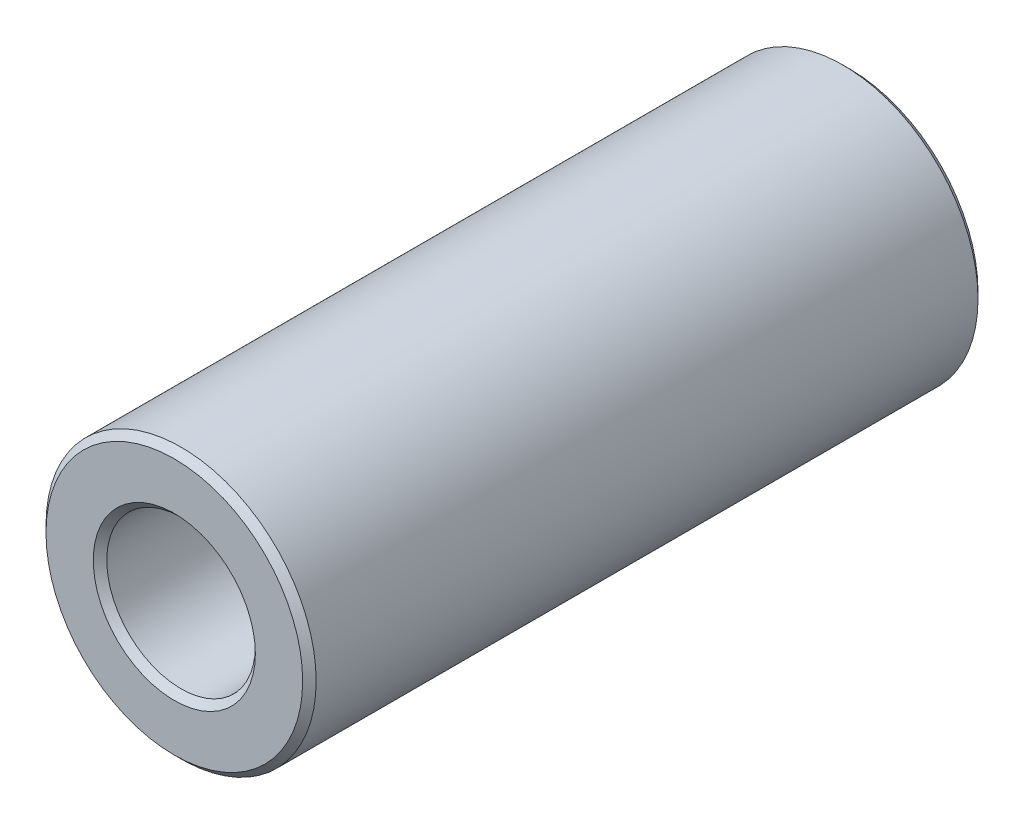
from build123d import *

# Parameters (mm, degrees)
SKETCH1_R           = 2
SKETCH1_R_2         = 1.1
BOSS_EXTRUDE2_DEPTH = 5
CHAMFER3_SIZE       = 0.1


with BuildPart() as part:
    # Sketch1 → Boss-Extrude2 (new, symmetric)
    with BuildSketch(Plane.XY):
        Circle(SKETCH1_R)
        Circle(SKETCH1_R_2, mode=Mode.SUBTRACT)
    extrude(amount=BOSS_EXTRUDE2_DEPTH, both=True)

    # Chamfer3
    chamfer3_edges = [part.edges().sort_by_distance(p)[0] for p in [
        (-2, 0, -5),
        (-2, 0, 5),
        (-1.1, 0, -5),
        (-1.1, 0, 5),
    ]]
    chamfer(chamfer3_edges, length=CHAMFER3_SIZE)


solid = part.part
